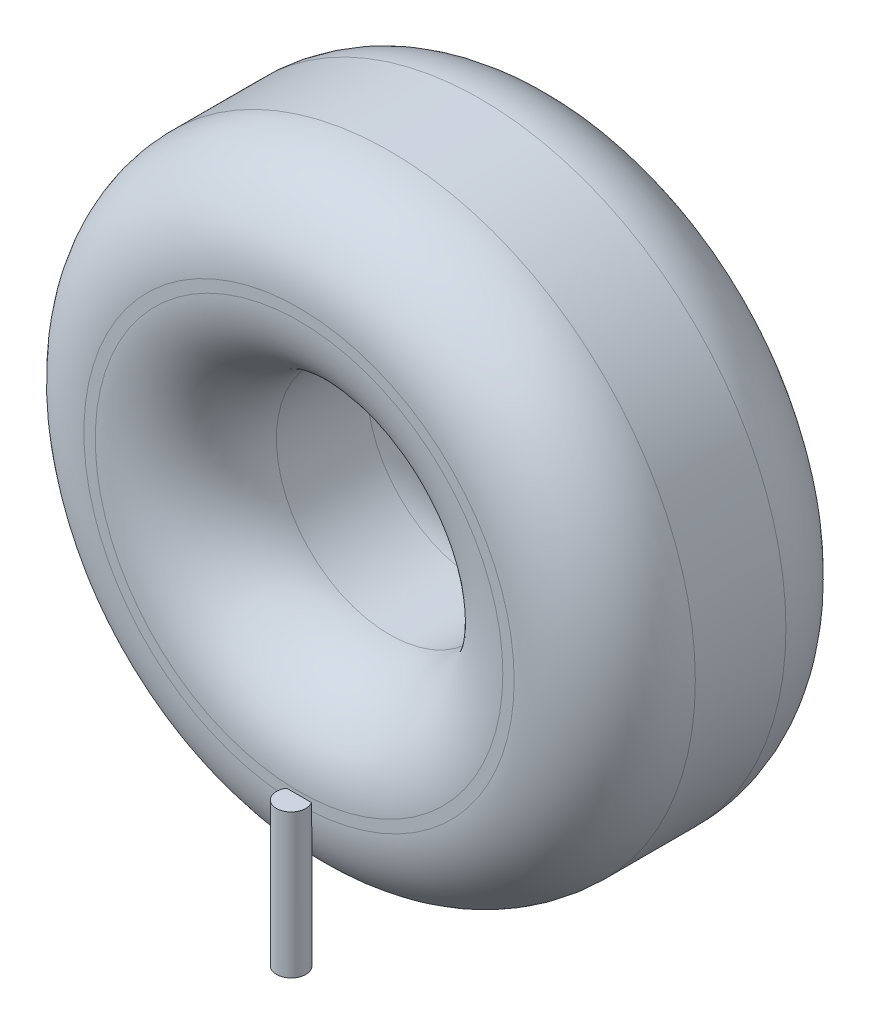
from build123d import *

# Parameters (mm, degrees)
SKETCH1_R           = 13.5
SKETCH1_R_2         = 5
BOSS_EXTRUDE1_DEPTH = 6
FILLET1_R           = 4
SKETCH2_R           = 0.65
BOSS_EXTRUDE2_DEPTH = 6.35


with BuildPart() as part:
    # Sketch1 → Boss-Extrude1 (new, symmetric)
    with BuildSketch(Plane.XY):
        Circle(SKETCH1_R)
        Circle(SKETCH1_R_2, mode=Mode.SUBTRACT)
    extrude(amount=BOSS_EXTRUDE1_DEPTH, both=True)

    # Fillet1
    fillet1_edges = [part.edges().sort_by_distance(p)[0] for p in [
        (-13.5, 0, -6),
        (-13.5, 0, 6),
        (-5, 0, -6),
        (-5, 0, 6),
    ]]
    fillet(fillet1_edges, radius=FILLET1_R)

    # Sketch2 → Boss-Extrude2 (add)
    with BuildSketch(Plane(origin=(0, -9.144, 0), x_dir=(-1, 0, 0), z_dir=(0, 1, 0))):
        with Locations(Location((0, 6.35, 0), (0, 0, 90))):
            Circle(SKETCH2_R)
        with Locations(Location((0, -6.35, 0), (0, 0, 147.421029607))):
            Circle(SKETCH2_R)
    extrude(amount=-BOSS_EXTRUDE2_DEPTH)


solid = part.part
